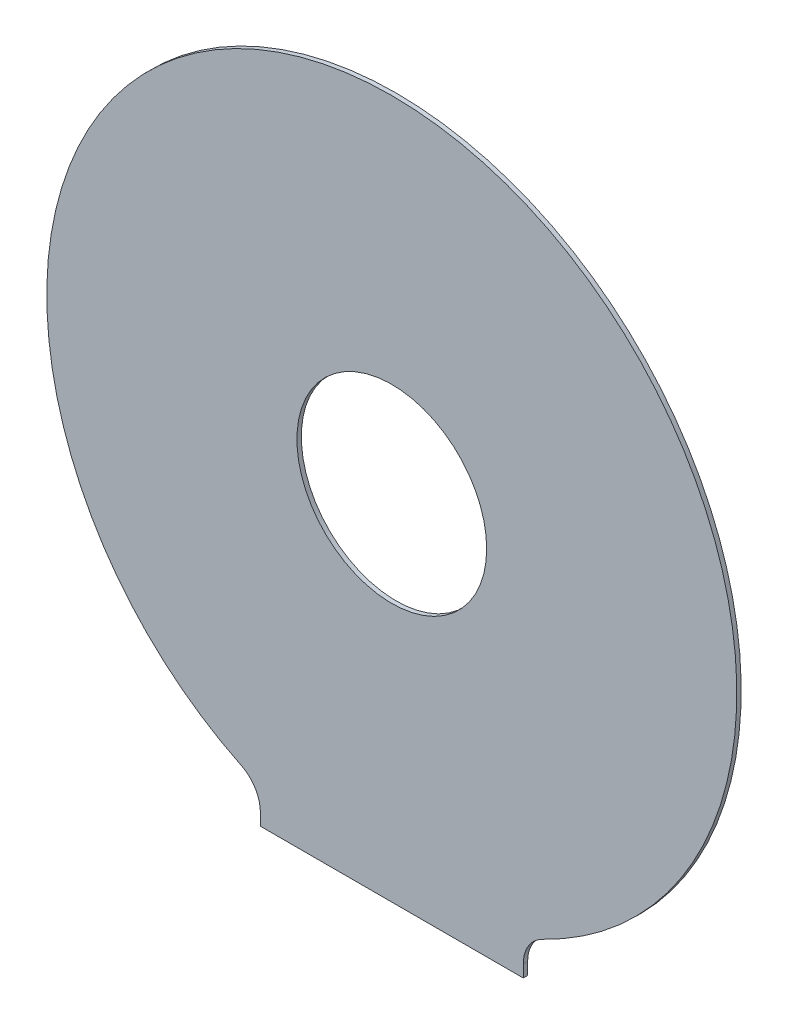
ISO-10303-21;
HEADER;
FILE_DESCRIPTION(('STEP AP214'),'2;1');
FILE_NAME('part.step','',(''),(''),'','','');
FILE_SCHEMA(('AUTOMOTIVE_DESIGN { 1 0 10303 214 1 1 1 1 }'));
ENDSEC;
DATA;
#1=APPLICATION_CONTEXT('core data for automotive mechanical design processes');
#2=APPLICATION_PROTOCOL_DEFINITION('international standard','automotive_design',2000,#1);
#3=PRODUCT_CONTEXT('',#1,'mechanical');
#4=PRODUCT('Part','Part','',(#3));
#5=PRODUCT_RELATED_PRODUCT_CATEGORY('part','',(#4));
#6=PRODUCT_DEFINITION_FORMATION('','',#4);
#7=PRODUCT_DEFINITION_CONTEXT('part definition',#1,'design');
#8=PRODUCT_DEFINITION('design','',#6,#7);
#9=PRODUCT_DEFINITION_SHAPE('','',#8);
#10=(LENGTH_UNIT() NAMED_UNIT(*) SI_UNIT(.MILLI.,.METRE.));
#11=(NAMED_UNIT(*) PLANE_ANGLE_UNIT() SI_UNIT($,.RADIAN.));
#12=(NAMED_UNIT(*) SI_UNIT($,.STERADIAN.) SOLID_ANGLE_UNIT());
#13=UNCERTAINTY_MEASURE_WITH_UNIT(LENGTH_MEASURE(1.E-05),#10,'distance_accuracy_value','');
#14=(GEOMETRIC_REPRESENTATION_CONTEXT(3) GLOBAL_UNCERTAINTY_ASSIGNED_CONTEXT((#13)) GLOBAL_UNIT_ASSIGNED_CONTEXT((#10,
#11,#12)) REPRESENTATION_CONTEXT('',''));
#15=CARTESIAN_POINT('',(0.,0.,0.));
#16=DIRECTION('',(0.,0.,1.));
#17=DIRECTION('',(1.,0.,0.));
#18=AXIS2_PLACEMENT_3D('',#15,#16,#17);
#19=CARTESIAN_POINT('',(4.81000000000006,-9.89261846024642,0.127));
#20=DIRECTION('',(0.,0.,1.));
#21=DIRECTION('',(1.,0.,0.));
#22=AXIS2_PLACEMENT_3D('',#19,#20,#21);
#23=PLANE('',#22);
#24=DIRECTION('',(1.,0.,0.));
#25=VECTOR('',#24,1.);
#26=CARTESIAN_POINT('',(-3.80999999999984,-10.2457503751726,0.127));
#27=LINE('',#26,#25);
#28=CARTESIAN_POINT('',(-3.80999999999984,-10.2457503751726,0.127));
#29=VERTEX_POINT('',#28);
#30=CARTESIAN_POINT('',(3.80999999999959,-10.2457503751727,0.127));
#31=VERTEX_POINT('',#30);
#32=EDGE_CURVE('E129',#29,#31,#27,.T.);
#33=ORIENTED_EDGE('',*,*,#32,.T.);
#34=DIRECTION('',(3.14393284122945E-13,1.,0.));
#35=VECTOR('',#34,1.);
#36=CARTESIAN_POINT('',(3.80999999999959,-10.2457503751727,0.127));
#37=LINE('',#36,#35);
#38=CARTESIAN_POINT('',(3.8099999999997,-9.89261846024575,0.127));
#39=VERTEX_POINT('',#38);
#40=EDGE_CURVE('E87',#31,#39,#37,.T.);
#41=ORIENTED_EDGE('',*,*,#40,.T.);
#42=CARTESIAN_POINT('',(4.81000000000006,-9.89261846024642,0.127));
#43=DIRECTION('',(0.,0.,-1.));
#44=DIRECTION('',(1.,0.,0.));
#45=AXIS2_PLACEMENT_3D('',#42,#43,#44);
#46=CIRCLE('',#45,1.00000000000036);
#47=CARTESIAN_POINT('',(4.37272727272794,-8.99328950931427,0.127));
#48=VERTEX_POINT('',#47);
#49=EDGE_CURVE('E100',#39,#48,#46,.T.);
#50=ORIENTED_EDGE('',*,*,#49,.T.);
#51=CARTESIAN_POINT('',(0.,0.,0.127));
#52=DIRECTION('',(0.,0.,1.));
#53=DIRECTION('',(1.,0.,0.));
#54=AXIS2_PLACEMENT_3D('',#51,#52,#53);
#55=CIRCLE('',#54,10.0000000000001);
#56=CARTESIAN_POINT('',(-4.37272727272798,-8.99328950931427,0.127));
#57=VERTEX_POINT('',#56);
#58=EDGE_CURVE('E94',#48,#57,#55,.T.);
#59=ORIENTED_EDGE('',*,*,#58,.T.);
#60=CARTESIAN_POINT('',(-4.81000000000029,-9.89261846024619,0.127));
#61=DIRECTION('',(0.,0.,-1.));
#62=DIRECTION('',(1.,0.,0.));
#63=AXIS2_PLACEMENT_3D('',#60,#61,#62);
#64=CIRCLE('',#63,1.00000000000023);
#65=CARTESIAN_POINT('',(-3.81000000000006,-9.89261846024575,0.127));
#66=VERTEX_POINT('',#65);
#67=EDGE_CURVE('E98',#57,#66,#64,.T.);
#68=ORIENTED_EDGE('',*,*,#67,.T.);
#69=DIRECTION('',(6.28786568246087E-13,-1.,0.));
#70=VECTOR('',#69,1.);
#71=CARTESIAN_POINT('',(-3.81000000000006,-9.89261846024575,0.127));
#72=LINE('',#71,#70);
#73=EDGE_CURVE('E50',#66,#29,#72,.T.);
#74=ORIENTED_EDGE('',*,*,#73,.T.);
#75=EDGE_LOOP('',(#33,#41,#50,#59,#68,#74));
#76=FACE_BOUND('',#75,.T.);
#77=CARTESIAN_POINT('',(0.,0.,0.127));
#78=DIRECTION('',(0.,0.,1.));
#79=DIRECTION('',(1.,0.,0.));
#80=AXIS2_PLACEMENT_3D('',#77,#78,#79);
#81=CIRCLE('',#80,2.75);
#82=CARTESIAN_POINT('',(2.75,0.,0.127));
#83=VERTEX_POINT('',#82);
#84=EDGE_CURVE('E122',#83,#83,#81,.T.);
#85=ORIENTED_EDGE('',*,*,#84,.F.);
#86=EDGE_LOOP('',(#85));
#87=FACE_BOUND('',#86,.T.);
#88=ADVANCED_FACE('F33',(#76,#87),#23,.T.);
#89=CARTESIAN_POINT('',(4.81000000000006,-9.89261846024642,0.));
#90=DIRECTION('',(0.,0.,1.));
#91=DIRECTION('',(1.,0.,0.));
#92=AXIS2_PLACEMENT_3D('',#89,#90,#91);
#93=PLANE('',#92);
#94=DIRECTION('',(1.,0.,0.));
#95=VECTOR('',#94,1.);
#96=CARTESIAN_POINT('',(-3.80999999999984,-10.2457503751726,0.));
#97=LINE('',#96,#95);
#98=CARTESIAN_POINT('',(-3.80999999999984,-10.2457503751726,0.));
#99=VERTEX_POINT('',#98);
#100=CARTESIAN_POINT('',(3.80999999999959,-10.2457503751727,0.));
#101=VERTEX_POINT('',#100);
#102=EDGE_CURVE('E118',#99,#101,#97,.T.);
#103=ORIENTED_EDGE('',*,*,#102,.F.);
#104=DIRECTION('',(6.28786568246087E-13,-1.,0.));
#105=VECTOR('',#104,1.);
#106=CARTESIAN_POINT('',(-3.81000000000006,-9.89261846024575,0.));
#107=LINE('',#106,#105);
#108=CARTESIAN_POINT('',(-3.81000000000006,-9.89261846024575,0.));
#109=VERTEX_POINT('',#108);
#110=EDGE_CURVE('E79',#109,#99,#107,.T.);
#111=ORIENTED_EDGE('',*,*,#110,.F.);
#112=CARTESIAN_POINT('',(-4.81000000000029,-9.89261846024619,0.));
#113=DIRECTION('',(0.,0.,-1.));
#114=DIRECTION('',(1.,0.,0.));
#115=AXIS2_PLACEMENT_3D('',#112,#113,#114);
#116=CIRCLE('',#115,1.00000000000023);
#117=CARTESIAN_POINT('',(-4.37272727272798,-8.99328950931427,0.));
#118=VERTEX_POINT('',#117);
#119=EDGE_CURVE('E73',#118,#109,#116,.T.);
#120=ORIENTED_EDGE('',*,*,#119,.F.);
#121=CARTESIAN_POINT('',(0.,0.,0.));
#122=DIRECTION('',(0.,0.,1.));
#123=DIRECTION('',(1.,0.,0.));
#124=AXIS2_PLACEMENT_3D('',#121,#122,#123);
#125=CIRCLE('',#124,10.0000000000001);
#126=CARTESIAN_POINT('',(4.37272727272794,-8.99328950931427,0.));
#127=VERTEX_POINT('',#126);
#128=EDGE_CURVE('E108',#127,#118,#125,.T.);
#129=ORIENTED_EDGE('',*,*,#128,.F.);
#130=CARTESIAN_POINT('',(4.81000000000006,-9.89261846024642,0.));
#131=DIRECTION('',(0.,0.,-1.));
#132=DIRECTION('',(1.,0.,0.));
#133=AXIS2_PLACEMENT_3D('',#130,#131,#132);
#134=CIRCLE('',#133,1.00000000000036);
#135=CARTESIAN_POINT('',(3.8099999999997,-9.89261846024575,0.));
#136=VERTEX_POINT('',#135);
#137=EDGE_CURVE('E124',#136,#127,#134,.T.);
#138=ORIENTED_EDGE('',*,*,#137,.F.);
#139=DIRECTION('',(3.14393284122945E-13,1.,0.));
#140=VECTOR('',#139,1.);
#141=CARTESIAN_POINT('',(3.80999999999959,-10.2457503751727,0.));
#142=LINE('',#141,#140);
#143=EDGE_CURVE('E121',#101,#136,#142,.T.);
#144=ORIENTED_EDGE('',*,*,#143,.F.);
#145=EDGE_LOOP('',(#103,#111,#120,#129,#138,#144));
#146=FACE_BOUND('',#145,.T.);
#147=CARTESIAN_POINT('',(0.,0.,0.));
#148=DIRECTION('',(0.,0.,1.));
#149=DIRECTION('',(1.,0.,0.));
#150=AXIS2_PLACEMENT_3D('',#147,#148,#149);
#151=CIRCLE('',#150,2.75);
#152=CARTESIAN_POINT('',(2.75,0.,0.));
#153=VERTEX_POINT('',#152);
#154=EDGE_CURVE('E222',#153,#153,#151,.T.);
#155=ORIENTED_EDGE('',*,*,#154,.T.);
#156=EDGE_LOOP('',(#155));
#157=FACE_BOUND('',#156,.T.);
#158=ADVANCED_FACE('F138',(#146,#157),#93,.F.);
#159=CARTESIAN_POINT('',(-3.80999999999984,-10.2457503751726,0.127));
#160=DIRECTION('',(0.,1.,0.));
#161=DIRECTION('',(-1.,0.,0.));
#162=AXIS2_PLACEMENT_3D('',#159,#160,#161);
#163=PLANE('',#162);
#164=ORIENTED_EDGE('',*,*,#102,.T.);
#165=DIRECTION('',(0.,0.,-1.));
#166=VECTOR('',#165,1.);
#167=CARTESIAN_POINT('',(3.80999999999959,-10.2457503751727,0.127));
#168=LINE('',#167,#166);
#169=EDGE_CURVE('E11',#31,#101,#168,.T.);
#170=ORIENTED_EDGE('',*,*,#169,.F.);
#171=ORIENTED_EDGE('',*,*,#32,.F.);
#172=DIRECTION('',(0.,0.,-1.));
#173=VECTOR('',#172,1.);
#174=CARTESIAN_POINT('',(-3.80999999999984,-10.2457503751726,0.127));
#175=LINE('',#174,#173);
#176=EDGE_CURVE('E114',#29,#99,#175,.T.);
#177=ORIENTED_EDGE('',*,*,#176,.T.);
#178=EDGE_LOOP('',(#164,#170,#171,#177));
#179=FACE_BOUND('',#178,.T.);
#180=ADVANCED_FACE('F35',(#179),#163,.F.);
#181=CARTESIAN_POINT('',(3.80999999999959,-10.2457503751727,0.127));
#182=DIRECTION('',(-1.,3.14393284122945E-13,0.));
#183=DIRECTION('',(-3.14393284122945E-13,-1.,0.));
#184=AXIS2_PLACEMENT_3D('',#181,#182,#183);
#185=PLANE('',#184);
#186=ORIENTED_EDGE('',*,*,#143,.T.);
#187=DIRECTION('',(0.,0.,-1.));
#188=VECTOR('',#187,1.);
#189=CARTESIAN_POINT('',(3.8099999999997,-9.89261846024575,0.127));
#190=LINE('',#189,#188);
#191=EDGE_CURVE('E42',#39,#136,#190,.T.);
#192=ORIENTED_EDGE('',*,*,#191,.F.);
#193=ORIENTED_EDGE('',*,*,#40,.F.);
#194=ORIENTED_EDGE('',*,*,#169,.T.);
#195=EDGE_LOOP('',(#186,#192,#193,#194));
#196=FACE_BOUND('',#195,.T.);
#197=ADVANCED_FACE('F163',(#196),#185,.F.);
#198=CARTESIAN_POINT('',(4.81000000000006,-9.89261846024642,0.127));
#199=DIRECTION('',(0.,0.,-1.));
#200=DIRECTION('',(-1.,0.,0.));
#201=AXIS2_PLACEMENT_3D('',#198,#199,#200);
#202=CYLINDRICAL_SURFACE('',#201,1.00000000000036);
#203=ORIENTED_EDGE('',*,*,#137,.T.);
#204=DIRECTION('',(0.,0.,-1.));
#205=VECTOR('',#204,1.);
#206=CARTESIAN_POINT('',(4.37272727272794,-8.99328950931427,0.127));
#207=LINE('',#206,#205);
#208=EDGE_CURVE('E109',#48,#127,#207,.T.);
#209=ORIENTED_EDGE('',*,*,#208,.F.);
#210=ORIENTED_EDGE('',*,*,#49,.F.);
#211=ORIENTED_EDGE('',*,*,#191,.T.);
#212=EDGE_LOOP('',(#203,#209,#210,#211));
#213=FACE_BOUND('',#212,.T.);
#214=ADVANCED_FACE('F135',(#213),#202,.F.);
#215=CARTESIAN_POINT('',(0.,0.,0.127));
#216=DIRECTION('',(0.,0.,-1.));
#217=DIRECTION('',(-1.,0.,0.));
#218=AXIS2_PLACEMENT_3D('',#215,#216,#217);
#219=CYLINDRICAL_SURFACE('',#218,10.0000000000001);
#220=ORIENTED_EDGE('',*,*,#128,.T.);
#221=DIRECTION('',(0.,0.,-1.));
#222=VECTOR('',#221,1.);
#223=CARTESIAN_POINT('',(-4.37272727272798,-8.99328950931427,0.127));
#224=LINE('',#223,#222);
#225=EDGE_CURVE('E105',#57,#118,#224,.T.);
#226=ORIENTED_EDGE('',*,*,#225,.F.);
#227=ORIENTED_EDGE('',*,*,#58,.F.);
#228=ORIENTED_EDGE('',*,*,#208,.T.);
#229=EDGE_LOOP('',(#220,#226,#227,#228));
#230=FACE_BOUND('',#229,.T.);
#231=ADVANCED_FACE('F106',(#230),#219,.T.);
#232=CARTESIAN_POINT('',(-4.81000000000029,-9.89261846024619,0.127));
#233=DIRECTION('',(0.,0.,-1.));
#234=DIRECTION('',(-1.,0.,0.));
#235=AXIS2_PLACEMENT_3D('',#232,#233,#234);
#236=CYLINDRICAL_SURFACE('',#235,1.00000000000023);
#237=ORIENTED_EDGE('',*,*,#119,.T.);
#238=DIRECTION('',(0.,0.,-1.));
#239=VECTOR('',#238,1.);
#240=CARTESIAN_POINT('',(-3.81000000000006,-9.89261846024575,0.127));
#241=LINE('',#240,#239);
#242=EDGE_CURVE('E110',#66,#109,#241,.T.);
#243=ORIENTED_EDGE('',*,*,#242,.F.);
#244=ORIENTED_EDGE('',*,*,#67,.F.);
#245=ORIENTED_EDGE('',*,*,#225,.T.);
#246=EDGE_LOOP('',(#237,#243,#244,#245));
#247=FACE_BOUND('',#246,.T.);
#248=ADVANCED_FACE('F112',(#247),#236,.F.);
#249=CARTESIAN_POINT('',(-3.81000000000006,-9.89261846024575,0.127));
#250=DIRECTION('',(1.,6.28786568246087E-13,0.));
#251=DIRECTION('',(-6.28786568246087E-13,1.,0.));
#252=AXIS2_PLACEMENT_3D('',#249,#250,#251);
#253=PLANE('',#252);
#254=ORIENTED_EDGE('',*,*,#110,.T.);
#255=ORIENTED_EDGE('',*,*,#176,.F.);
#256=ORIENTED_EDGE('',*,*,#73,.F.);
#257=ORIENTED_EDGE('',*,*,#242,.T.);
#258=EDGE_LOOP('',(#254,#255,#256,#257));
#259=FACE_BOUND('',#258,.T.);
#260=ADVANCED_FACE('F143',(#259),#253,.F.);
#261=CARTESIAN_POINT('',(0.,0.,0.127));
#262=DIRECTION('',(0.,0.,-1.));
#263=DIRECTION('',(-1.,0.,0.));
#264=AXIS2_PLACEMENT_3D('',#261,#262,#263);
#265=CYLINDRICAL_SURFACE('',#264,2.75);
#266=ORIENTED_EDGE('',*,*,#84,.T.);
#267=EDGE_LOOP('',(#266));
#268=FACE_BOUND('',#267,.T.);
#269=ORIENTED_EDGE('',*,*,#154,.F.);
#270=EDGE_LOOP('',(#269));
#271=FACE_BOUND('',#270,.T.);
#272=ADVANCED_FACE('F145',(#268,#271),#265,.F.);
#273=CLOSED_SHELL('',(#88,#158,#180,#197,#214,#231,#248,#260,#272));
#274=MANIFOLD_SOLID_BREP('B2',#273);
#275=ADVANCED_BREP_SHAPE_REPRESENTATION('',(#18,#274),#14);
#276=SHAPE_DEFINITION_REPRESENTATION(#9,#275);
ENDSEC;
END-ISO-10303-21;
